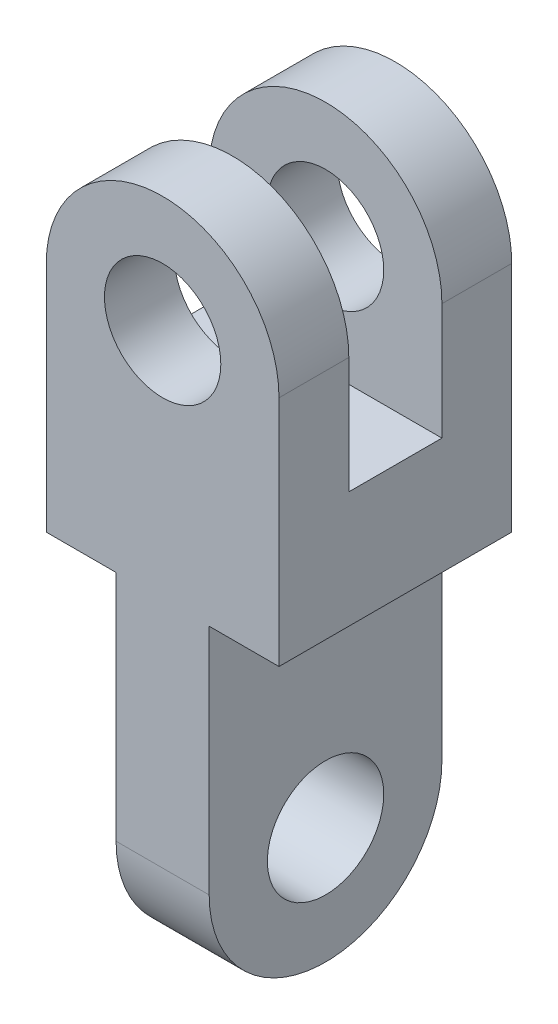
ISO-10303-21;
HEADER;
FILE_DESCRIPTION(('STEP AP214'),'2;1');
FILE_NAME('part.step','',(''),(''),'','','');
FILE_SCHEMA(('AUTOMOTIVE_DESIGN { 1 0 10303 214 1 1 1 1 }'));
ENDSEC;
DATA;
#1=APPLICATION_CONTEXT('core data for automotive mechanical design processes');
#2=APPLICATION_PROTOCOL_DEFINITION('international standard','automotive_design',2000,#1);
#3=PRODUCT_CONTEXT('',#1,'mechanical');
#4=PRODUCT('Part','Part','',(#3));
#5=PRODUCT_RELATED_PRODUCT_CATEGORY('part','',(#4));
#6=PRODUCT_DEFINITION_FORMATION('','',#4);
#7=PRODUCT_DEFINITION_CONTEXT('part definition',#1,'design');
#8=PRODUCT_DEFINITION('design','',#6,#7);
#9=PRODUCT_DEFINITION_SHAPE('','',#8);
#10=(LENGTH_UNIT() NAMED_UNIT(*) SI_UNIT(.MILLI.,.METRE.));
#11=(NAMED_UNIT(*) PLANE_ANGLE_UNIT() SI_UNIT($,.RADIAN.));
#12=(NAMED_UNIT(*) SI_UNIT($,.STERADIAN.) SOLID_ANGLE_UNIT());
#13=UNCERTAINTY_MEASURE_WITH_UNIT(LENGTH_MEASURE(1.E-05),#10,'distance_accuracy_value','');
#14=(GEOMETRIC_REPRESENTATION_CONTEXT(3) GLOBAL_UNCERTAINTY_ASSIGNED_CONTEXT((#13)) GLOBAL_UNIT_ASSIGNED_CONTEXT((#10,
#11,#12)) REPRESENTATION_CONTEXT('',''));
#15=CARTESIAN_POINT('',(0.,0.,0.));
#16=DIRECTION('',(0.,0.,1.));
#17=DIRECTION('',(1.,0.,0.));
#18=AXIS2_PLACEMENT_3D('',#15,#16,#17);
#19=CARTESIAN_POINT('',(-50.,0.,50.));
#20=DIRECTION('',(0.,1.,0.));
#21=DIRECTION('',(-1.,0.,0.));
#22=AXIS2_PLACEMENT_3D('',#19,#20,#21);
#23=PLANE('',#22);
#24=DIRECTION('',(0.,0.,1.));
#25=VECTOR('',#24,1.);
#26=CARTESIAN_POINT('',(20.,0.,50.));
#27=LINE('',#26,#25);
#28=CARTESIAN_POINT('',(20.,0.,-50.));
#29=VERTEX_POINT('',#28);
#30=CARTESIAN_POINT('',(20.,0.,50.));
#31=VERTEX_POINT('',#30);
#32=EDGE_CURVE('E41',#29,#31,#27,.T.);
#33=ORIENTED_EDGE('',*,*,#32,.F.);
#34=DIRECTION('',(1.,0.,0.));
#35=VECTOR('',#34,1.);
#36=CARTESIAN_POINT('',(-50.,0.,-50.));
#37=LINE('',#36,#35);
#38=CARTESIAN_POINT('',(50.,0.,-50.));
#39=VERTEX_POINT('',#38);
#40=EDGE_CURVE('E167',#29,#39,#37,.T.);
#41=ORIENTED_EDGE('',*,*,#40,.T.);
#42=DIRECTION('',(0.,0.,-1.));
#43=VECTOR('',#42,1.);
#44=CARTESIAN_POINT('',(50.,0.,50.));
#45=LINE('',#44,#43);
#46=CARTESIAN_POINT('',(50.,0.,50.));
#47=VERTEX_POINT('',#46);
#48=EDGE_CURVE('E176',#47,#39,#45,.T.);
#49=ORIENTED_EDGE('',*,*,#48,.F.);
#50=DIRECTION('',(1.,0.,0.));
#51=VECTOR('',#50,1.);
#52=CARTESIAN_POINT('',(-50.,0.,50.));
#53=LINE('',#52,#51);
#54=EDGE_CURVE('E151',#31,#47,#53,.T.);
#55=ORIENTED_EDGE('',*,*,#54,.F.);
#56=EDGE_LOOP('',(#33,#41,#49,#55));
#57=FACE_BOUND('',#56,.T.);
#58=ADVANCED_FACE('F16',(#57),#23,.F.);
#59=CARTESIAN_POINT('',(0.,100.,50.));
#60=DIRECTION('',(0.,0.,-1.));
#61=DIRECTION('',(-1.,0.,0.));
#62=AXIS2_PLACEMENT_3D('',#59,#60,#61);
#63=CYLINDRICAL_SURFACE('',#62,50.);
#64=DIRECTION('',(0.,0.,-1.));
#65=VECTOR('',#64,1.);
#66=CARTESIAN_POINT('',(50.,100.,50.));
#67=LINE('',#66,#65);
#68=CARTESIAN_POINT('',(50.,100.,50.));
#69=VERTEX_POINT('',#68);
#70=CARTESIAN_POINT('',(50.,100.,20.));
#71=VERTEX_POINT('',#70);
#72=EDGE_CURVE('E180',#69,#71,#67,.T.);
#73=ORIENTED_EDGE('',*,*,#72,.T.);
#74=CARTESIAN_POINT('',(0.,100.,20.));
#75=DIRECTION('',(0.,0.,1.));
#76=DIRECTION('',(0.,-1.,0.));
#77=AXIS2_PLACEMENT_3D('',#74,#75,#76);
#78=CIRCLE('',#77,50.);
#79=CARTESIAN_POINT('',(-50.,100.,20.));
#80=VERTEX_POINT('',#79);
#81=EDGE_CURVE('E11',#71,#80,#78,.T.);
#82=ORIENTED_EDGE('',*,*,#81,.T.);
#83=DIRECTION('',(0.,0.,-1.));
#84=VECTOR('',#83,1.);
#85=CARTESIAN_POINT('',(-50.,100.,50.));
#86=LINE('',#85,#84);
#87=CARTESIAN_POINT('',(-50.,100.,50.));
#88=VERTEX_POINT('',#87);
#89=EDGE_CURVE('E194',#88,#80,#86,.T.);
#90=ORIENTED_EDGE('',*,*,#89,.F.);
#91=CARTESIAN_POINT('',(0.,100.,50.));
#92=DIRECTION('',(0.,0.,1.));
#93=DIRECTION('',(-1.,0.,0.));
#94=AXIS2_PLACEMENT_3D('',#91,#92,#93);
#95=CIRCLE('',#94,50.);
#96=EDGE_CURVE('E187',#69,#88,#95,.T.);
#97=ORIENTED_EDGE('',*,*,#96,.F.);
#98=EDGE_LOOP('',(#73,#82,#90,#97));
#99=FACE_BOUND('',#98,.T.);
#100=ADVANCED_FACE('F233',(#99),#63,.T.);
#101=CARTESIAN_POINT('',(-50.,0.,50.));
#102=DIRECTION('',(1.,0.,0.));
#103=DIRECTION('',(0.,0.,-1.));
#104=AXIS2_PLACEMENT_3D('',#101,#102,#103);
#105=PLANE('',#104);
#106=ORIENTED_EDGE('',*,*,#89,.T.);
#107=DIRECTION('',(0.,-1.,0.));
#108=VECTOR('',#107,1.);
#109=CARTESIAN_POINT('',(-50.,150.,20.));
#110=LINE('',#109,#108);
#111=CARTESIAN_POINT('',(-50.,50.,20.));
#112=VERTEX_POINT('',#111);
#113=EDGE_CURVE('E263',#80,#112,#110,.T.);
#114=ORIENTED_EDGE('',*,*,#113,.T.);
#115=DIRECTION('',(0.,0.,-1.));
#116=VECTOR('',#115,1.);
#117=CARTESIAN_POINT('',(-50.,50.,20.));
#118=LINE('',#117,#116);
#119=CARTESIAN_POINT('',(-50.,50.,-20.));
#120=VERTEX_POINT('',#119);
#121=EDGE_CURVE('E273',#112,#120,#118,.T.);
#122=ORIENTED_EDGE('',*,*,#121,.T.);
#123=DIRECTION('',(0.,1.,0.));
#124=VECTOR('',#123,1.);
#125=CARTESIAN_POINT('',(-50.,150.,-20.));
#126=LINE('',#125,#124);
#127=CARTESIAN_POINT('',(-50.,100.,-20.));
#128=VERTEX_POINT('',#127);
#129=EDGE_CURVE('E270',#120,#128,#126,.T.);
#130=ORIENTED_EDGE('',*,*,#129,.T.);
#131=CARTESIAN_POINT('',(-50.,100.,-50.));
#132=VERTEX_POINT('',#131);
#133=EDGE_CURVE('E189',#128,#132,#86,.T.);
#134=ORIENTED_EDGE('',*,*,#133,.T.);
#135=DIRECTION('',(0.,-1.,0.));
#136=VECTOR('',#135,1.);
#137=CARTESIAN_POINT('',(-50.,0.,-50.));
#138=LINE('',#137,#136);
#139=CARTESIAN_POINT('',(-50.,0.,-50.));
#140=VERTEX_POINT('',#139);
#141=EDGE_CURVE('E212',#132,#140,#138,.T.);
#142=ORIENTED_EDGE('',*,*,#141,.T.);
#143=DIRECTION('',(0.,0.,-1.));
#144=VECTOR('',#143,1.);
#145=CARTESIAN_POINT('',(-50.,0.,50.));
#146=LINE('',#145,#144);
#147=CARTESIAN_POINT('',(-50.,0.,50.));
#148=VERTEX_POINT('',#147);
#149=EDGE_CURVE('E179',#148,#140,#146,.T.);
#150=ORIENTED_EDGE('',*,*,#149,.F.);
#151=DIRECTION('',(0.,-1.,0.));
#152=VECTOR('',#151,1.);
#153=CARTESIAN_POINT('',(-50.,0.,50.));
#154=LINE('',#153,#152);
#155=EDGE_CURVE('E174',#88,#148,#154,.T.);
#156=ORIENTED_EDGE('',*,*,#155,.F.);
#157=EDGE_LOOP('',(#106,#114,#122,#130,#134,#142,#150,#156));
#158=FACE_BOUND('',#157,.T.);
#159=ADVANCED_FACE('F18',(#158),#105,.F.);
#160=CARTESIAN_POINT('',(-20.,0.,-50.));
#161=VERTEX_POINT('',#160);
#162=EDGE_CURVE('E163',#140,#161,#37,.T.);
#163=ORIENTED_EDGE('',*,*,#162,.T.);
#164=DIRECTION('',(0.,0.,1.));
#165=VECTOR('',#164,1.);
#166=CARTESIAN_POINT('',(-20.,0.,50.));
#167=LINE('',#166,#165);
#168=CARTESIAN_POINT('',(-20.,0.,50.));
#169=VERTEX_POINT('',#168);
#170=EDGE_CURVE('E33',#161,#169,#167,.T.);
#171=ORIENTED_EDGE('',*,*,#170,.T.);
#172=EDGE_CURVE('E130',#148,#169,#53,.T.);
#173=ORIENTED_EDGE('',*,*,#172,.F.);
#174=ORIENTED_EDGE('',*,*,#149,.T.);
#175=EDGE_LOOP('',(#163,#171,#173,#174));
#176=FACE_BOUND('',#175,.T.);
#177=ADVANCED_FACE('F223',(#176),#23,.F.);
#178=CARTESIAN_POINT('',(50.,0.,50.));
#179=DIRECTION('',(-1.,0.,0.));
#180=DIRECTION('',(0.,-1.,0.));
#181=AXIS2_PLACEMENT_3D('',#178,#179,#180);
#182=PLANE('',#181);
#183=DIRECTION('',(0.,0.,-1.));
#184=VECTOR('',#183,1.);
#185=CARTESIAN_POINT('',(50.,50.,20.));
#186=LINE('',#185,#184);
#187=CARTESIAN_POINT('',(50.,50.,20.));
#188=VERTEX_POINT('',#187);
#189=CARTESIAN_POINT('',(50.,50.,-20.));
#190=VERTEX_POINT('',#189);
#191=EDGE_CURVE('E264',#188,#190,#186,.T.);
#192=ORIENTED_EDGE('',*,*,#191,.F.);
#193=DIRECTION('',(0.,-1.,0.));
#194=VECTOR('',#193,1.);
#195=CARTESIAN_POINT('',(50.,150.,20.));
#196=LINE('',#195,#194);
#197=EDGE_CURVE('E279',#71,#188,#196,.T.);
#198=ORIENTED_EDGE('',*,*,#197,.F.);
#199=ORIENTED_EDGE('',*,*,#72,.F.);
#200=DIRECTION('',(0.,1.,0.));
#201=VECTOR('',#200,1.);
#202=CARTESIAN_POINT('',(50.,0.,50.));
#203=LINE('',#202,#201);
#204=EDGE_CURVE('E172',#47,#69,#203,.T.);
#205=ORIENTED_EDGE('',*,*,#204,.F.);
#206=ORIENTED_EDGE('',*,*,#48,.T.);
#207=DIRECTION('',(0.,1.,0.));
#208=VECTOR('',#207,1.);
#209=CARTESIAN_POINT('',(50.,0.,-50.));
#210=LINE('',#209,#208);
#211=CARTESIAN_POINT('',(50.,100.,-50.));
#212=VERTEX_POINT('',#211);
#213=EDGE_CURVE('E208',#39,#212,#210,.T.);
#214=ORIENTED_EDGE('',*,*,#213,.T.);
#215=CARTESIAN_POINT('',(50.,100.,-20.));
#216=VERTEX_POINT('',#215);
#217=EDGE_CURVE('E197',#216,#212,#67,.T.);
#218=ORIENTED_EDGE('',*,*,#217,.F.);
#219=DIRECTION('',(0.,1.,0.));
#220=VECTOR('',#219,1.);
#221=CARTESIAN_POINT('',(50.,150.,-20.));
#222=LINE('',#221,#220);
#223=EDGE_CURVE('E259',#190,#216,#222,.T.);
#224=ORIENTED_EDGE('',*,*,#223,.F.);
#225=EDGE_LOOP('',(#192,#198,#199,#205,#206,#214,#218,#224));
#226=FACE_BOUND('',#225,.T.);
#227=ADVANCED_FACE('F183',(#226),#182,.F.);
#228=CARTESIAN_POINT('',(0.,100.,-20.));
#229=DIRECTION('',(0.,0.,-1.));
#230=DIRECTION('',(0.,1.,0.));
#231=AXIS2_PLACEMENT_3D('',#228,#229,#230);
#232=CIRCLE('',#231,50.);
#233=EDGE_CURVE('E25',#128,#216,#232,.T.);
#234=ORIENTED_EDGE('',*,*,#233,.T.);
#235=ORIENTED_EDGE('',*,*,#217,.T.);
#236=CARTESIAN_POINT('',(0.,100.,-50.));
#237=DIRECTION('',(0.,0.,1.));
#238=DIRECTION('',(-1.,0.,0.));
#239=AXIS2_PLACEMENT_3D('',#236,#237,#238);
#240=CIRCLE('',#239,50.);
#241=EDGE_CURVE('E216',#212,#132,#240,.T.);
#242=ORIENTED_EDGE('',*,*,#241,.T.);
#243=ORIENTED_EDGE('',*,*,#133,.F.);
#244=EDGE_LOOP('',(#234,#235,#242,#243));
#245=FACE_BOUND('',#244,.T.);
#246=ADVANCED_FACE('F231',(#245),#63,.T.);
#247=CARTESIAN_POINT('',(0.,100.,50.));
#248=DIRECTION('',(0.,0.,-1.));
#249=DIRECTION('',(-1.,0.,0.));
#250=AXIS2_PLACEMENT_3D('',#247,#248,#249);
#251=PLANE('',#250);
#252=CARTESIAN_POINT('',(0.,100.,50.));
#253=DIRECTION('',(0.,0.,1.));
#254=DIRECTION('',(1.,0.,0.));
#255=AXIS2_PLACEMENT_3D('',#252,#253,#254);
#256=CIRCLE('',#255,25.);
#257=CARTESIAN_POINT('',(25.,100.,50.));
#258=VERTEX_POINT('',#257);
#259=EDGE_CURVE('E125',#258,#258,#256,.T.);
#260=ORIENTED_EDGE('',*,*,#259,.F.);
#261=EDGE_LOOP('',(#260));
#262=FACE_BOUND('',#261,.T.);
#263=ORIENTED_EDGE('',*,*,#155,.T.);
#264=ORIENTED_EDGE('',*,*,#172,.T.);
#265=DIRECTION('',(0.,-1.,0.));
#266=VECTOR('',#265,1.);
#267=CARTESIAN_POINT('',(-20.,0.,50.));
#268=LINE('',#267,#266);
#269=CARTESIAN_POINT('',(-20.,-100.,50.));
#270=VERTEX_POINT('',#269);
#271=EDGE_CURVE('E111',#169,#270,#268,.T.);
#272=ORIENTED_EDGE('',*,*,#271,.T.);
#273=DIRECTION('',(-1.,0.,0.));
#274=VECTOR('',#273,1.);
#275=CARTESIAN_POINT('',(20.,-100.,50.));
#276=LINE('',#275,#274);
#277=CARTESIAN_POINT('',(20.,-100.,50.));
#278=VERTEX_POINT('',#277);
#279=EDGE_CURVE('E119',#278,#270,#276,.T.);
#280=ORIENTED_EDGE('',*,*,#279,.F.);
#281=DIRECTION('',(0.,-1.,0.));
#282=VECTOR('',#281,1.);
#283=CARTESIAN_POINT('',(20.,0.,50.));
#284=LINE('',#283,#282);
#285=EDGE_CURVE('E138',#31,#278,#284,.T.);
#286=ORIENTED_EDGE('',*,*,#285,.F.);
#287=ORIENTED_EDGE('',*,*,#54,.T.);
#288=ORIENTED_EDGE('',*,*,#204,.T.);
#289=ORIENTED_EDGE('',*,*,#96,.T.);
#290=EDGE_LOOP('',(#263,#264,#272,#280,#286,#287,#288,#289));
#291=FACE_BOUND('',#290,.T.);
#292=ADVANCED_FACE('F129',(#262,#291),#251,.F.);
#293=CARTESIAN_POINT('',(0.,100.,-50.));
#294=DIRECTION('',(0.,0.,-1.));
#295=DIRECTION('',(-1.,0.,0.));
#296=AXIS2_PLACEMENT_3D('',#293,#294,#295);
#297=PLANE('',#296);
#298=CARTESIAN_POINT('',(0.,100.,-50.));
#299=DIRECTION('',(0.,0.,1.));
#300=DIRECTION('',(1.,0.,0.));
#301=AXIS2_PLACEMENT_3D('',#298,#299,#300);
#302=CIRCLE('',#301,25.);
#303=CARTESIAN_POINT('',(25.,100.,-50.));
#304=VERTEX_POINT('',#303);
#305=EDGE_CURVE('E205',#304,#304,#302,.T.);
#306=ORIENTED_EDGE('',*,*,#305,.T.);
#307=EDGE_LOOP('',(#306));
#308=FACE_BOUND('',#307,.T.);
#309=ORIENTED_EDGE('',*,*,#141,.F.);
#310=ORIENTED_EDGE('',*,*,#241,.F.);
#311=ORIENTED_EDGE('',*,*,#213,.F.);
#312=ORIENTED_EDGE('',*,*,#40,.F.);
#313=DIRECTION('',(0.,1.,0.));
#314=VECTOR('',#313,1.);
#315=CARTESIAN_POINT('',(20.,0.,-50.));
#316=LINE('',#315,#314);
#317=CARTESIAN_POINT('',(20.,-100.,-50.));
#318=VERTEX_POINT('',#317);
#319=EDGE_CURVE('E145',#318,#29,#316,.T.);
#320=ORIENTED_EDGE('',*,*,#319,.F.);
#321=DIRECTION('',(-1.,0.,0.));
#322=VECTOR('',#321,1.);
#323=CARTESIAN_POINT('',(20.,-100.,-50.));
#324=LINE('',#323,#322);
#325=CARTESIAN_POINT('',(-20.,-100.,-50.));
#326=VERTEX_POINT('',#325);
#327=EDGE_CURVE('E126',#318,#326,#324,.T.);
#328=ORIENTED_EDGE('',*,*,#327,.T.);
#329=DIRECTION('',(0.,1.,0.));
#330=VECTOR('',#329,1.);
#331=CARTESIAN_POINT('',(-20.,0.,-50.));
#332=LINE('',#331,#330);
#333=EDGE_CURVE('E113',#326,#161,#332,.T.);
#334=ORIENTED_EDGE('',*,*,#333,.T.);
#335=ORIENTED_EDGE('',*,*,#162,.F.);
#336=EDGE_LOOP('',(#309,#310,#311,#312,#320,#328,#334,#335));
#337=FACE_BOUND('',#336,.T.);
#338=ADVANCED_FACE('F162',(#308,#337),#297,.T.);
#339=CARTESIAN_POINT('',(-50.,150.,20.));
#340=DIRECTION('',(0.,0.,1.));
#341=DIRECTION('',(0.,-1.,0.));
#342=AXIS2_PLACEMENT_3D('',#339,#340,#341);
#343=PLANE('',#342);
#344=CARTESIAN_POINT('',(0.,100.,20.));
#345=DIRECTION('',(0.,0.,1.));
#346=DIRECTION('',(0.,-1.,0.));
#347=AXIS2_PLACEMENT_3D('',#344,#345,#346);
#348=CIRCLE('',#347,25.);
#349=CARTESIAN_POINT('',(0.,75.,20.));
#350=VERTEX_POINT('',#349);
#351=EDGE_CURVE('E204',#350,#350,#348,.T.);
#352=ORIENTED_EDGE('',*,*,#351,.T.);
#353=EDGE_LOOP('',(#352));
#354=FACE_BOUND('',#353,.T.);
#355=ORIENTED_EDGE('',*,*,#197,.T.);
#356=DIRECTION('',(1.,0.,0.));
#357=VECTOR('',#356,1.);
#358=CARTESIAN_POINT('',(-50.,50.,20.));
#359=LINE('',#358,#357);
#360=EDGE_CURVE('E267',#112,#188,#359,.T.);
#361=ORIENTED_EDGE('',*,*,#360,.F.);
#362=ORIENTED_EDGE('',*,*,#113,.F.);
#363=ORIENTED_EDGE('',*,*,#81,.F.);
#364=EDGE_LOOP('',(#355,#361,#362,#363));
#365=FACE_BOUND('',#364,.T.);
#366=ADVANCED_FACE('F295',(#354,#365),#343,.F.);
#367=CARTESIAN_POINT('',(-50.,150.,-20.));
#368=DIRECTION('',(0.,0.,-1.));
#369=DIRECTION('',(0.,1.,0.));
#370=AXIS2_PLACEMENT_3D('',#367,#368,#369);
#371=PLANE('',#370);
#372=CARTESIAN_POINT('',(0.,100.,-20.));
#373=DIRECTION('',(0.,0.,-1.));
#374=DIRECTION('',(0.,1.,0.));
#375=AXIS2_PLACEMENT_3D('',#372,#373,#374);
#376=CIRCLE('',#375,25.);
#377=CARTESIAN_POINT('',(0.,125.,-20.));
#378=VERTEX_POINT('',#377);
#379=EDGE_CURVE('E201',#378,#378,#376,.T.);
#380=ORIENTED_EDGE('',*,*,#379,.T.);
#381=EDGE_LOOP('',(#380));
#382=FACE_BOUND('',#381,.T.);
#383=ORIENTED_EDGE('',*,*,#233,.F.);
#384=ORIENTED_EDGE('',*,*,#129,.F.);
#385=DIRECTION('',(1.,0.,0.));
#386=VECTOR('',#385,1.);
#387=CARTESIAN_POINT('',(-50.,50.,-20.));
#388=LINE('',#387,#386);
#389=EDGE_CURVE('E261',#120,#190,#388,.T.);
#390=ORIENTED_EDGE('',*,*,#389,.T.);
#391=ORIENTED_EDGE('',*,*,#223,.T.);
#392=EDGE_LOOP('',(#383,#384,#390,#391));
#393=FACE_BOUND('',#392,.T.);
#394=ADVANCED_FACE('F260',(#382,#393),#371,.F.);
#395=CARTESIAN_POINT('',(-50.,50.,20.));
#396=DIRECTION('',(0.,-1.,0.));
#397=DIRECTION('',(0.,0.,-1.));
#398=AXIS2_PLACEMENT_3D('',#395,#396,#397);
#399=PLANE('',#398);
#400=ORIENTED_EDGE('',*,*,#191,.T.);
#401=ORIENTED_EDGE('',*,*,#389,.F.);
#402=ORIENTED_EDGE('',*,*,#121,.F.);
#403=ORIENTED_EDGE('',*,*,#360,.T.);
#404=EDGE_LOOP('',(#400,#401,#402,#403));
#405=FACE_BOUND('',#404,.T.);
#406=ADVANCED_FACE('F301',(#405),#399,.F.);
#407=CARTESIAN_POINT('',(0.,100.,-50.));
#408=DIRECTION('',(0.,0.,1.));
#409=DIRECTION('',(1.,0.,0.));
#410=AXIS2_PLACEMENT_3D('',#407,#408,#409);
#411=CYLINDRICAL_SURFACE('',#410,25.);
#412=ORIENTED_EDGE('',*,*,#305,.F.);
#413=EDGE_LOOP('',(#412));
#414=FACE_BOUND('',#413,.T.);
#415=ORIENTED_EDGE('',*,*,#379,.F.);
#416=EDGE_LOOP('',(#415));
#417=FACE_BOUND('',#416,.T.);
#418=ADVANCED_FACE('F291',(#414,#417),#411,.F.);
#419=ORIENTED_EDGE('',*,*,#259,.T.);
#420=EDGE_LOOP('',(#419));
#421=FACE_BOUND('',#420,.T.);
#422=ORIENTED_EDGE('',*,*,#351,.F.);
#423=EDGE_LOOP('',(#422));
#424=FACE_BOUND('',#423,.T.);
#425=ADVANCED_FACE('F288',(#421,#424),#411,.F.);
#426=CARTESIAN_POINT('',(20.,-100.,0.));
#427=DIRECTION('',(-1.,0.,0.));
#428=DIRECTION('',(0.,0.,1.));
#429=AXIS2_PLACEMENT_3D('',#426,#427,#428);
#430=CYLINDRICAL_SURFACE('',#429,50.);
#431=CARTESIAN_POINT('',(-20.,-100.,0.));
#432=DIRECTION('',(1.,0.,0.));
#433=DIRECTION('',(0.,0.,1.));
#434=AXIS2_PLACEMENT_3D('',#431,#432,#433);
#435=CIRCLE('',#434,50.);
#436=EDGE_CURVE('E107',#270,#326,#435,.T.);
#437=ORIENTED_EDGE('',*,*,#436,.T.);
#438=ORIENTED_EDGE('',*,*,#327,.F.);
#439=CARTESIAN_POINT('',(20.,-100.,0.));
#440=DIRECTION('',(1.,0.,0.));
#441=DIRECTION('',(0.,0.,1.));
#442=AXIS2_PLACEMENT_3D('',#439,#440,#441);
#443=CIRCLE('',#442,50.);
#444=EDGE_CURVE('E121',#278,#318,#443,.T.);
#445=ORIENTED_EDGE('',*,*,#444,.F.);
#446=ORIENTED_EDGE('',*,*,#279,.T.);
#447=EDGE_LOOP('',(#437,#438,#445,#446));
#448=FACE_BOUND('',#447,.T.);
#449=ADVANCED_FACE('F120',(#448),#430,.T.);
#450=CARTESIAN_POINT('',(20.,-100.,0.));
#451=DIRECTION('',(-1.,0.,0.));
#452=DIRECTION('',(0.,0.,1.));
#453=AXIS2_PLACEMENT_3D('',#450,#451,#452);
#454=PLANE('',#453);
#455=CARTESIAN_POINT('',(20.,-100.,0.));
#456=DIRECTION('',(1.,0.,0.));
#457=DIRECTION('',(0.,0.,-1.));
#458=AXIS2_PLACEMENT_3D('',#455,#456,#457);
#459=CIRCLE('',#458,25.);
#460=CARTESIAN_POINT('',(20.,-100.,-25.));
#461=VERTEX_POINT('',#460);
#462=EDGE_CURVE('E133',#461,#461,#459,.T.);
#463=ORIENTED_EDGE('',*,*,#462,.F.);
#464=EDGE_LOOP('',(#463));
#465=FACE_BOUND('',#464,.T.);
#466=ORIENTED_EDGE('',*,*,#285,.T.);
#467=ORIENTED_EDGE('',*,*,#444,.T.);
#468=ORIENTED_EDGE('',*,*,#319,.T.);
#469=ORIENTED_EDGE('',*,*,#32,.T.);
#470=EDGE_LOOP('',(#466,#467,#468,#469));
#471=FACE_BOUND('',#470,.T.);
#472=ADVANCED_FACE('F169',(#465,#471),#454,.F.);
#473=CARTESIAN_POINT('',(-20.,-100.,0.));
#474=DIRECTION('',(-1.,0.,0.));
#475=DIRECTION('',(0.,0.,1.));
#476=AXIS2_PLACEMENT_3D('',#473,#474,#475);
#477=PLANE('',#476);
#478=CARTESIAN_POINT('',(-20.,-100.,0.));
#479=DIRECTION('',(-1.,0.,0.));
#480=DIRECTION('',(0.,0.,1.));
#481=AXIS2_PLACEMENT_3D('',#478,#479,#480);
#482=CIRCLE('',#481,25.);
#483=CARTESIAN_POINT('',(-20.,-100.,25.));
#484=VERTEX_POINT('',#483);
#485=EDGE_CURVE('E20',#484,#484,#482,.T.);
#486=ORIENTED_EDGE('',*,*,#485,.F.);
#487=EDGE_LOOP('',(#486));
#488=FACE_BOUND('',#487,.T.);
#489=ORIENTED_EDGE('',*,*,#271,.F.);
#490=ORIENTED_EDGE('',*,*,#170,.F.);
#491=ORIENTED_EDGE('',*,*,#333,.F.);
#492=ORIENTED_EDGE('',*,*,#436,.F.);
#493=EDGE_LOOP('',(#489,#490,#491,#492));
#494=FACE_BOUND('',#493,.T.);
#495=ADVANCED_FACE('F109',(#488,#494),#477,.T.);
#496=CARTESIAN_POINT('',(-50.000025,-100.,0.));
#497=DIRECTION('',(1.,0.,0.));
#498=DIRECTION('',(0.,0.,-1.));
#499=AXIS2_PLACEMENT_3D('',#496,#497,#498);
#500=CYLINDRICAL_SURFACE('',#499,25.);
#501=ORIENTED_EDGE('',*,*,#485,.T.);
#502=EDGE_LOOP('',(#501));
#503=FACE_BOUND('',#502,.T.);
#504=ORIENTED_EDGE('',*,*,#462,.T.);
#505=EDGE_LOOP('',(#504));
#506=FACE_BOUND('',#505,.T.);
#507=ADVANCED_FACE('F378',(#503,#506),#500,.F.);
#508=CLOSED_SHELL('',(#58,#100,#159,#177,#227,#246,#292,#338,#366,#394,#406,#418,#425,#449,#472,
#495,#507));
#509=MANIFOLD_SOLID_BREP('B1',#508);
#510=ADVANCED_BREP_SHAPE_REPRESENTATION('',(#18,#509),#14);
#511=SHAPE_DEFINITION_REPRESENTATION(#9,#510);
ENDSEC;
END-ISO-10303-21;
